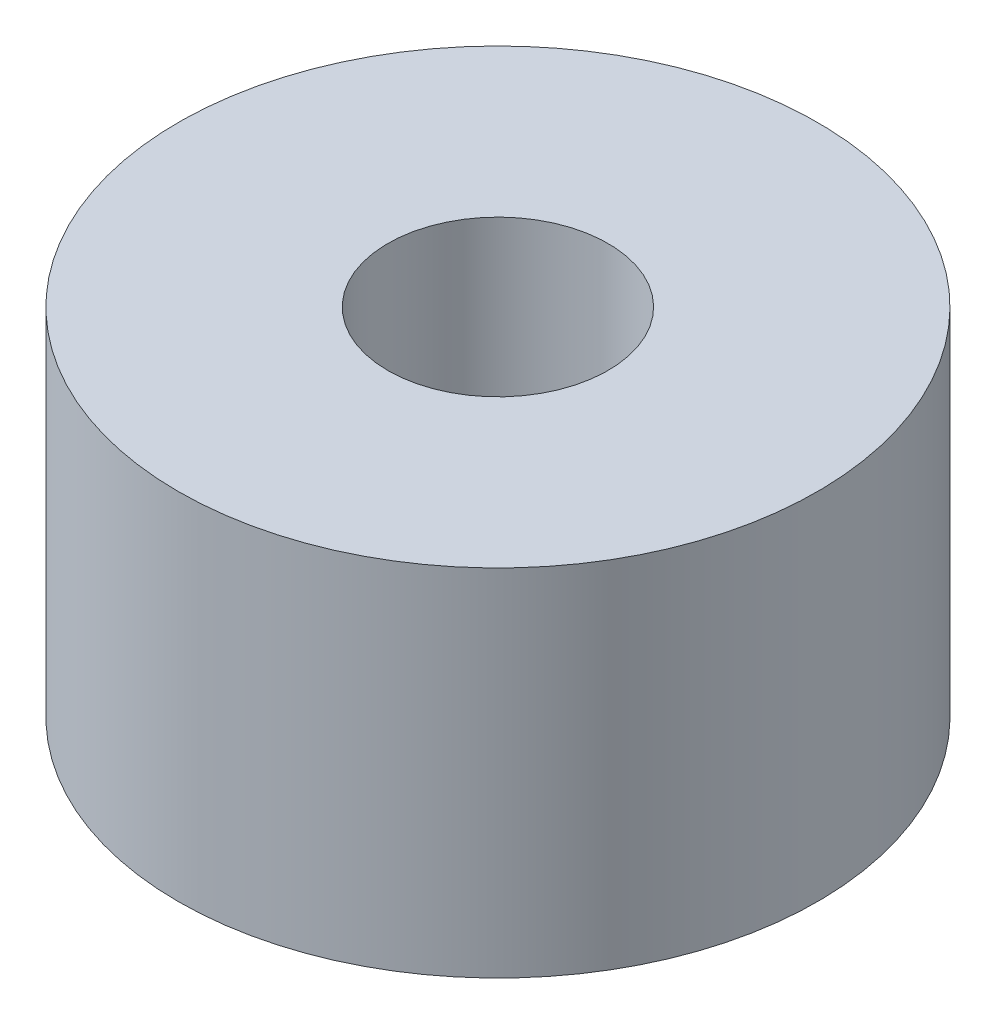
from build123d import *

# Parameters (mm, degrees)
SKETCH1_R           = 4.5
SKETCH1_R_2         = 1.55
BOSS_EXTRUDE1_DEPTH = 5


with BuildPart() as part:
    # Sketch1 → Boss-Extrude1 (new body)
    with BuildSketch(Plane(origin=(0, 0, 0), x_dir=(1, 0, 0), z_dir=(0, 1, 0))):
        with Locations(Location((0, 0, 0), (0, 0, 270))):
            Circle(SKETCH1_R)
        with Locations(Location((0, 0, 0), (0, 0, 270))):
            Circle(SKETCH1_R_2, mode=Mode.SUBTRACT)
    extrude(amount=BOSS_EXTRUDE1_DEPTH)


solid = part.part
